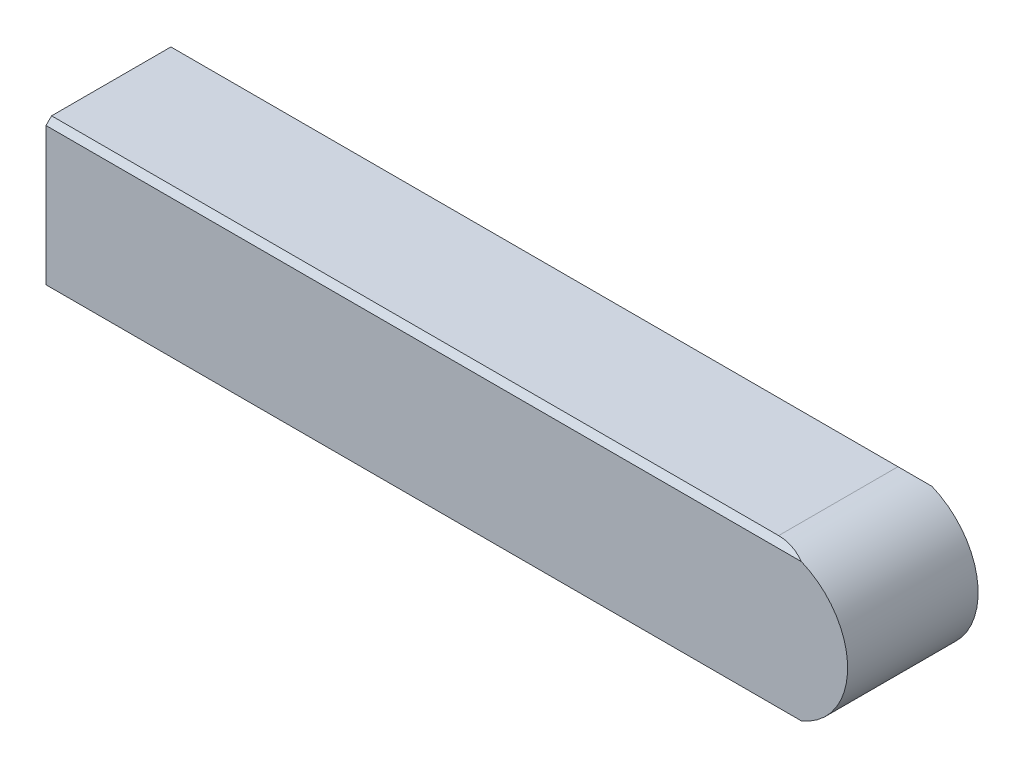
from build123d import *

# Parameters (mm, degrees)
BOSS_EXTRUDE1_DEPTH = 7
SKETCH2_W           = 14
SKETCH2_H           = 16
CUT_EXTRUDE1_DEPTH  = 43


with BuildPart() as part:
    # Sketch1 → Boss-Extrude1 (new body)
    with BuildSketch(Plane.XY):
        with BuildLine():
            Line((0, 0), (39, 0))
            ThreePointArc((39, 0), (41.828427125, 1.171572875), (43, 4))
            ThreePointArc((43, 4), (41.828427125, 6.828427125), (39, 8))
            Line((39, 8), (0, 8))
            Line((0, 8), (0, 0))
        make_face()
    extrude(amount=BOSS_EXTRUDE1_DEPTH)

    # Sketch2 → Cut-Extrude1 (cut)
    with BuildSketch(Plane(origin=(0, 0, 0), x_dir=(0, 0, -1), z_dir=(1, 0, 0))):
        with Locations((-3.5, 4)):
            Rectangle(SKETCH2_W, SKETCH2_H)
        Polygon((-7, 0.3), (-6.7, 0), (-0.3, 0), (0, 0.3), (0, 7.7), (-0.3, 8), (-6.7, 8), (-7, 7.7), align=None, mode=Mode.SUBTRACT)
    extrude(amount=CUT_EXTRUDE1_DEPTH, mode=Mode.SUBTRACT)


solid = part.part
